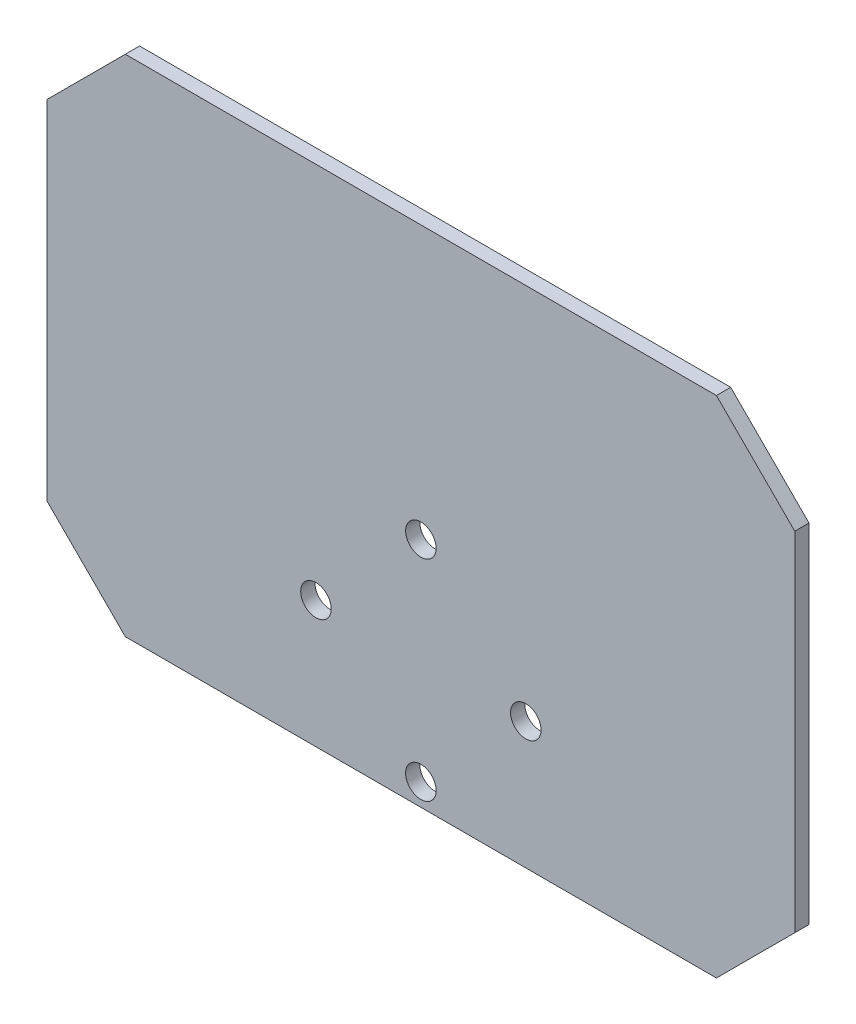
ISO-10303-21;
HEADER;
FILE_DESCRIPTION(('STEP AP214'),'2;1');
FILE_NAME('part.step','',(''),(''),'','','');
FILE_SCHEMA(('AUTOMOTIVE_DESIGN { 1 0 10303 214 1 1 1 1 }'));
ENDSEC;
DATA;
#1=APPLICATION_CONTEXT('core data for automotive mechanical design processes');
#2=APPLICATION_PROTOCOL_DEFINITION('international standard','automotive_design',2000,#1);
#3=PRODUCT_CONTEXT('',#1,'mechanical');
#4=PRODUCT('Part','Part','',(#3));
#5=PRODUCT_RELATED_PRODUCT_CATEGORY('part','',(#4));
#6=PRODUCT_DEFINITION_FORMATION('','',#4);
#7=PRODUCT_DEFINITION_CONTEXT('part definition',#1,'design');
#8=PRODUCT_DEFINITION('design','',#6,#7);
#9=PRODUCT_DEFINITION_SHAPE('','',#8);
#10=(LENGTH_UNIT() NAMED_UNIT(*) SI_UNIT(.MILLI.,.METRE.));
#11=(NAMED_UNIT(*) PLANE_ANGLE_UNIT() SI_UNIT($,.RADIAN.));
#12=(NAMED_UNIT(*) SI_UNIT($,.STERADIAN.) SOLID_ANGLE_UNIT());
#13=UNCERTAINTY_MEASURE_WITH_UNIT(LENGTH_MEASURE(1.E-05),#10,'distance_accuracy_value','');
#14=(GEOMETRIC_REPRESENTATION_CONTEXT(3) GLOBAL_UNCERTAINTY_ASSIGNED_CONTEXT((#13)) GLOBAL_UNIT_ASSIGNED_CONTEXT((#10,
#11,#12)) REPRESENTATION_CONTEXT('',''));
#15=CARTESIAN_POINT('',(0.,0.,0.));
#16=DIRECTION('',(0.,0.,1.));
#17=DIRECTION('',(1.,0.,0.));
#18=AXIS2_PLACEMENT_3D('',#15,#16,#17);
#19=CARTESIAN_POINT('',(-40.005,26.9875,1.524));
#20=DIRECTION('',(1.,0.,0.));
#21=DIRECTION('',(0.,0.,-1.));
#22=AXIS2_PLACEMENT_3D('',#19,#20,#21);
#23=PLANE('',#22);
#24=DIRECTION('',(0.,-1.,0.));
#25=VECTOR('',#24,1.);
#26=CARTESIAN_POINT('',(-40.005,26.9875,0.));
#27=LINE('',#26,#25);
#28=CARTESIAN_POINT('',(-40.005,18.6055,0.));
#29=VERTEX_POINT('',#28);
#30=CARTESIAN_POINT('',(-40.005,-18.6055,0.));
#31=VERTEX_POINT('',#30);
#32=EDGE_CURVE('E126',#29,#31,#27,.T.);
#33=ORIENTED_EDGE('',*,*,#32,.T.);
#34=DIRECTION('',(0.,0.,1.));
#35=VECTOR('',#34,1.);
#36=CARTESIAN_POINT('',(-40.005,-18.6055,1.524));
#37=LINE('',#36,#35);
#38=CARTESIAN_POINT('',(-40.005,-18.6055,1.524));
#39=VERTEX_POINT('',#38);
#40=EDGE_CURVE('E104',#31,#39,#37,.T.);
#41=ORIENTED_EDGE('',*,*,#40,.T.);
#42=DIRECTION('',(0.,-1.,0.));
#43=VECTOR('',#42,1.);
#44=CARTESIAN_POINT('',(-40.005,26.9875,1.524));
#45=LINE('',#44,#43);
#46=CARTESIAN_POINT('',(-40.005,18.6055,1.524));
#47=VERTEX_POINT('',#46);
#48=EDGE_CURVE('E136',#47,#39,#45,.T.);
#49=ORIENTED_EDGE('',*,*,#48,.F.);
#50=DIRECTION('',(0.,0.,-1.));
#51=VECTOR('',#50,1.);
#52=CARTESIAN_POINT('',(-40.005,18.6055,1.524));
#53=LINE('',#52,#51);
#54=EDGE_CURVE('E109',#47,#29,#53,.T.);
#55=ORIENTED_EDGE('',*,*,#54,.T.);
#56=EDGE_LOOP('',(#33,#41,#49,#55));
#57=FACE_BOUND('',#56,.T.);
#58=ADVANCED_FACE('F33',(#57),#23,.F.);
#59=CARTESIAN_POINT('',(-40.005,-26.9875,1.524));
#60=DIRECTION('',(0.,1.,0.));
#61=DIRECTION('',(-1.,0.,0.));
#62=AXIS2_PLACEMENT_3D('',#59,#60,#61);
#63=PLANE('',#62);
#64=DIRECTION('',(1.,0.,0.));
#65=VECTOR('',#64,1.);
#66=CARTESIAN_POINT('',(-40.005,-26.9875,1.524));
#67=LINE('',#66,#65);
#68=CARTESIAN_POINT('',(-31.623,-26.9875,1.524));
#69=VERTEX_POINT('',#68);
#70=CARTESIAN_POINT('',(31.623,-26.9875,1.524));
#71=VERTEX_POINT('',#70);
#72=EDGE_CURVE('E119',#69,#71,#67,.T.);
#73=ORIENTED_EDGE('',*,*,#72,.F.);
#74=DIRECTION('',(0.,0.,-1.));
#75=VECTOR('',#74,1.);
#76=CARTESIAN_POINT('',(-31.623,-26.9875,1.524));
#77=LINE('',#76,#75);
#78=CARTESIAN_POINT('',(-31.623,-26.9875,0.));
#79=VERTEX_POINT('',#78);
#80=EDGE_CURVE('E103',#69,#79,#77,.T.);
#81=ORIENTED_EDGE('',*,*,#80,.T.);
#82=DIRECTION('',(1.,0.,0.));
#83=VECTOR('',#82,1.);
#84=CARTESIAN_POINT('',(-40.005,-26.9875,0.));
#85=LINE('',#84,#83);
#86=CARTESIAN_POINT('',(31.623,-26.9875,0.));
#87=VERTEX_POINT('',#86);
#88=EDGE_CURVE('E116',#79,#87,#85,.T.);
#89=ORIENTED_EDGE('',*,*,#88,.T.);
#90=DIRECTION('',(0.,0.,1.));
#91=VECTOR('',#90,1.);
#92=CARTESIAN_POINT('',(31.623,-26.9875,1.524));
#93=LINE('',#92,#91);
#94=EDGE_CURVE('E121',#87,#71,#93,.T.);
#95=ORIENTED_EDGE('',*,*,#94,.T.);
#96=EDGE_LOOP('',(#73,#81,#89,#95));
#97=FACE_BOUND('',#96,.T.);
#98=ADVANCED_FACE('F115',(#97),#63,.F.);
#99=CARTESIAN_POINT('',(40.005,26.9875,1.524));
#100=DIRECTION('',(-1.,0.,0.));
#101=DIRECTION('',(0.,0.,1.));
#102=AXIS2_PLACEMENT_3D('',#99,#100,#101);
#103=PLANE('',#102);
#104=DIRECTION('',(0.,1.,0.));
#105=VECTOR('',#104,1.);
#106=CARTESIAN_POINT('',(40.005,26.9875,1.524));
#107=LINE('',#106,#105);
#108=CARTESIAN_POINT('',(40.005,-18.6055,1.524));
#109=VERTEX_POINT('',#108);
#110=CARTESIAN_POINT('',(40.005,18.6055,1.524));
#111=VERTEX_POINT('',#110);
#112=EDGE_CURVE('E162',#109,#111,#107,.T.);
#113=ORIENTED_EDGE('',*,*,#112,.F.);
#114=DIRECTION('',(0.,0.,-1.));
#115=VECTOR('',#114,1.);
#116=CARTESIAN_POINT('',(40.005,-18.6055,1.524));
#117=LINE('',#116,#115);
#118=CARTESIAN_POINT('',(40.005,-18.6055,0.));
#119=VERTEX_POINT('',#118);
#120=EDGE_CURVE('E155',#109,#119,#117,.T.);
#121=ORIENTED_EDGE('',*,*,#120,.T.);
#122=DIRECTION('',(0.,1.,0.));
#123=VECTOR('',#122,1.);
#124=CARTESIAN_POINT('',(40.005,26.9875,0.));
#125=LINE('',#124,#123);
#126=CARTESIAN_POINT('',(40.005,18.6055,0.));
#127=VERTEX_POINT('',#126);
#128=EDGE_CURVE('E125',#119,#127,#125,.T.);
#129=ORIENTED_EDGE('',*,*,#128,.T.);
#130=DIRECTION('',(0.,0.,1.));
#131=VECTOR('',#130,1.);
#132=CARTESIAN_POINT('',(40.005,18.6055,1.524));
#133=LINE('',#132,#131);
#134=EDGE_CURVE('E153',#127,#111,#133,.T.);
#135=ORIENTED_EDGE('',*,*,#134,.T.);
#136=EDGE_LOOP('',(#113,#121,#129,#135));
#137=FACE_BOUND('',#136,.T.);
#138=ADVANCED_FACE('F160',(#137),#103,.F.);
#139=CARTESIAN_POINT('',(-40.005,26.9875,1.524));
#140=DIRECTION('',(0.,-1.,0.));
#141=DIRECTION('',(1.,0.,0.));
#142=AXIS2_PLACEMENT_3D('',#139,#140,#141);
#143=PLANE('',#142);
#144=DIRECTION('',(-1.,0.,0.));
#145=VECTOR('',#144,1.);
#146=CARTESIAN_POINT('',(-40.005,26.9875,1.524));
#147=LINE('',#146,#145);
#148=CARTESIAN_POINT('',(31.623,26.9875,1.524));
#149=VERTEX_POINT('',#148);
#150=CARTESIAN_POINT('',(-31.623,26.9875,1.524));
#151=VERTEX_POINT('',#150);
#152=EDGE_CURVE('E137',#149,#151,#147,.T.);
#153=ORIENTED_EDGE('',*,*,#152,.F.);
#154=DIRECTION('',(0.,0.,-1.));
#155=VECTOR('',#154,1.);
#156=CARTESIAN_POINT('',(31.623,26.9875,1.524));
#157=LINE('',#156,#155);
#158=CARTESIAN_POINT('',(31.623,26.9875,0.));
#159=VERTEX_POINT('',#158);
#160=EDGE_CURVE('E11',#149,#159,#157,.T.);
#161=ORIENTED_EDGE('',*,*,#160,.T.);
#162=DIRECTION('',(-1.,0.,0.));
#163=VECTOR('',#162,1.);
#164=CARTESIAN_POINT('',(-40.005,26.9875,0.));
#165=LINE('',#164,#163);
#166=CARTESIAN_POINT('',(-31.623,26.9875,0.));
#167=VERTEX_POINT('',#166);
#168=EDGE_CURVE('E129',#159,#167,#165,.T.);
#169=ORIENTED_EDGE('',*,*,#168,.T.);
#170=DIRECTION('',(0.,0.,1.));
#171=VECTOR('',#170,1.);
#172=CARTESIAN_POINT('',(-31.623,26.9875,1.524));
#173=LINE('',#172,#171);
#174=EDGE_CURVE('E41',#167,#151,#173,.T.);
#175=ORIENTED_EDGE('',*,*,#174,.T.);
#176=EDGE_LOOP('',(#153,#161,#169,#175));
#177=FACE_BOUND('',#176,.T.);
#178=ADVANCED_FACE('F169',(#177),#143,.F.);
#179=CARTESIAN_POINT('',(0.,0.,1.524));
#180=DIRECTION('',(0.,0.,1.));
#181=DIRECTION('',(1.,0.,0.));
#182=AXIS2_PLACEMENT_3D('',#179,#180,#181);
#183=PLANE('',#182);
#184=CARTESIAN_POINT('',(0.,-2.17169999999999,1.524));
#185=DIRECTION('',(0.,0.,1.));
#186=DIRECTION('',(1.,0.,0.));
#187=AXIS2_PLACEMENT_3D('',#184,#185,#186);
#188=CIRCLE('',#187,1.63195);
#189=CARTESIAN_POINT('',(1.63194999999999,-2.17169999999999,1.524));
#190=VERTEX_POINT('',#189);
#191=EDGE_CURVE('E193',#190,#190,#188,.T.);
#192=ORIENTED_EDGE('',*,*,#191,.F.);
#193=EDGE_LOOP('',(#192));
#194=FACE_BOUND('',#193,.T.);
#195=CARTESIAN_POINT('',(0.,-24.6253,1.524));
#196=DIRECTION('',(0.,0.,1.));
#197=DIRECTION('',(1.,0.,0.));
#198=AXIS2_PLACEMENT_3D('',#195,#196,#197);
#199=CIRCLE('',#198,1.63195);
#200=CARTESIAN_POINT('',(1.63194999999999,-24.6253,1.524));
#201=VERTEX_POINT('',#200);
#202=EDGE_CURVE('E187',#201,#201,#199,.T.);
#203=ORIENTED_EDGE('',*,*,#202,.F.);
#204=EDGE_LOOP('',(#203));
#205=FACE_BOUND('',#204,.T.);
#206=CARTESIAN_POINT('',(11.2268,-13.3985,1.524));
#207=DIRECTION('',(0.,0.,1.));
#208=DIRECTION('',(1.,0.,0.));
#209=AXIS2_PLACEMENT_3D('',#206,#207,#208);
#210=CIRCLE('',#209,1.63194999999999);
#211=CARTESIAN_POINT('',(12.85875,-13.3985,1.524));
#212=VERTEX_POINT('',#211);
#213=EDGE_CURVE('E181',#212,#212,#210,.T.);
#214=ORIENTED_EDGE('',*,*,#213,.F.);
#215=EDGE_LOOP('',(#214));
#216=FACE_BOUND('',#215,.T.);
#217=CARTESIAN_POINT('',(-11.2268,-13.3985,1.524));
#218=DIRECTION('',(0.,0.,1.));
#219=DIRECTION('',(1.,0.,0.));
#220=AXIS2_PLACEMENT_3D('',#217,#218,#219);
#221=CIRCLE('',#220,1.63194999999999);
#222=CARTESIAN_POINT('',(-9.59485000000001,-13.3985,1.524));
#223=VERTEX_POINT('',#222);
#224=EDGE_CURVE('E131',#223,#223,#221,.T.);
#225=ORIENTED_EDGE('',*,*,#224,.F.);
#226=EDGE_LOOP('',(#225));
#227=FACE_BOUND('',#226,.T.);
#228=ORIENTED_EDGE('',*,*,#48,.T.);
#229=DIRECTION('',(-0.707106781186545,0.70710678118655,0.));
#230=VECTOR('',#229,1.);
#231=CARTESIAN_POINT('',(-29.3052500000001,-29.3052499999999,1.524));
#232=LINE('',#231,#230);
#233=EDGE_CURVE('E151',#39,#69,#232,.F.);
#234=ORIENTED_EDGE('',*,*,#233,.T.);
#235=ORIENTED_EDGE('',*,*,#72,.T.);
#236=DIRECTION('',(-0.707106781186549,-0.707106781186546,0.));
#237=VECTOR('',#236,1.);
#238=CARTESIAN_POINT('',(29.3052499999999,-29.30525,1.524));
#239=LINE('',#238,#237);
#240=EDGE_CURVE('E149',#71,#109,#239,.F.);
#241=ORIENTED_EDGE('',*,*,#240,.T.);
#242=ORIENTED_EDGE('',*,*,#112,.T.);
#243=DIRECTION('',(0.707106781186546,-0.707106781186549,0.));
#244=VECTOR('',#243,1.);
#245=CARTESIAN_POINT('',(29.3052500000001,29.3052499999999,1.524));
#246=LINE('',#245,#244);
#247=EDGE_CURVE('E54',#111,#149,#246,.F.);
#248=ORIENTED_EDGE('',*,*,#247,.T.);
#249=ORIENTED_EDGE('',*,*,#152,.T.);
#250=DIRECTION('',(0.70710678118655,0.707106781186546,0.));
#251=VECTOR('',#250,1.);
#252=CARTESIAN_POINT('',(-29.3052499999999,29.3052500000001,1.524));
#253=LINE('',#252,#251);
#254=EDGE_CURVE('E146',#151,#47,#253,.F.);
#255=ORIENTED_EDGE('',*,*,#254,.T.);
#256=EDGE_LOOP('',(#228,#234,#235,#241,#242,#248,#249,#255));
#257=FACE_BOUND('',#256,.T.);
#258=ADVANCED_FACE('F204',(#194,#205,#216,#227,#257),#183,.T.);
#259=CARTESIAN_POINT('',(0.,0.,0.));
#260=DIRECTION('',(0.,0.,1.));
#261=DIRECTION('',(1.,0.,0.));
#262=AXIS2_PLACEMENT_3D('',#259,#260,#261);
#263=PLANE('',#262);
#264=CARTESIAN_POINT('',(0.,-2.17169999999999,0.));
#265=DIRECTION('',(0.,0.,-1.));
#266=DIRECTION('',(-1.,0.,0.));
#267=AXIS2_PLACEMENT_3D('',#264,#265,#266);
#268=CIRCLE('',#267,1.63195);
#269=CARTESIAN_POINT('',(-1.63195,-2.17169999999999,0.));
#270=VERTEX_POINT('',#269);
#271=EDGE_CURVE('E196',#270,#270,#268,.T.);
#272=ORIENTED_EDGE('',*,*,#271,.F.);
#273=EDGE_LOOP('',(#272));
#274=FACE_BOUND('',#273,.T.);
#275=CARTESIAN_POINT('',(0.,-24.6253,0.));
#276=DIRECTION('',(0.,0.,-1.));
#277=DIRECTION('',(-1.,0.,0.));
#278=AXIS2_PLACEMENT_3D('',#275,#276,#277);
#279=CIRCLE('',#278,1.63195);
#280=CARTESIAN_POINT('',(-1.63195,-24.6253,0.));
#281=VERTEX_POINT('',#280);
#282=EDGE_CURVE('E190',#281,#281,#279,.T.);
#283=ORIENTED_EDGE('',*,*,#282,.F.);
#284=EDGE_LOOP('',(#283));
#285=FACE_BOUND('',#284,.T.);
#286=CARTESIAN_POINT('',(11.2268,-13.3985,0.));
#287=DIRECTION('',(0.,0.,-1.));
#288=DIRECTION('',(-1.,0.,0.));
#289=AXIS2_PLACEMENT_3D('',#286,#287,#288);
#290=CIRCLE('',#289,1.63195);
#291=CARTESIAN_POINT('',(9.59485,-13.3985,0.));
#292=VERTEX_POINT('',#291);
#293=EDGE_CURVE('E184',#292,#292,#290,.T.);
#294=ORIENTED_EDGE('',*,*,#293,.F.);
#295=EDGE_LOOP('',(#294));
#296=FACE_BOUND('',#295,.T.);
#297=CARTESIAN_POINT('',(-11.2268,-13.3985,0.));
#298=DIRECTION('',(0.,0.,-1.));
#299=DIRECTION('',(-1.,0.,0.));
#300=AXIS2_PLACEMENT_3D('',#297,#298,#299);
#301=CIRCLE('',#300,1.63195);
#302=CARTESIAN_POINT('',(-12.85875,-13.3985,0.));
#303=VERTEX_POINT('',#302);
#304=EDGE_CURVE('E178',#303,#303,#301,.T.);
#305=ORIENTED_EDGE('',*,*,#304,.F.);
#306=EDGE_LOOP('',(#305));
#307=FACE_BOUND('',#306,.T.);
#308=ORIENTED_EDGE('',*,*,#88,.F.);
#309=DIRECTION('',(0.707106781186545,-0.70710678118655,0.));
#310=VECTOR('',#309,1.);
#311=CARTESIAN_POINT('',(-31.623,-26.9875,0.));
#312=LINE('',#311,#310);
#313=EDGE_CURVE('E99',#79,#31,#312,.F.);
#314=ORIENTED_EDGE('',*,*,#313,.T.);
#315=ORIENTED_EDGE('',*,*,#32,.F.);
#316=DIRECTION('',(-0.70710678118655,-0.707106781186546,0.));
#317=VECTOR('',#316,1.);
#318=CARTESIAN_POINT('',(-40.005,18.6055,0.));
#319=LINE('',#318,#317);
#320=EDGE_CURVE('E120',#29,#167,#319,.F.);
#321=ORIENTED_EDGE('',*,*,#320,.T.);
#322=ORIENTED_EDGE('',*,*,#168,.F.);
#323=DIRECTION('',(-0.707106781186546,0.707106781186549,0.));
#324=VECTOR('',#323,1.);
#325=CARTESIAN_POINT('',(31.623,26.9875,0.));
#326=LINE('',#325,#324);
#327=EDGE_CURVE('E140',#159,#127,#326,.F.);
#328=ORIENTED_EDGE('',*,*,#327,.T.);
#329=ORIENTED_EDGE('',*,*,#128,.F.);
#330=DIRECTION('',(0.707106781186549,0.707106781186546,0.));
#331=VECTOR('',#330,1.);
#332=CARTESIAN_POINT('',(40.005,-18.6055,0.));
#333=LINE('',#332,#331);
#334=EDGE_CURVE('E110',#119,#87,#333,.F.);
#335=ORIENTED_EDGE('',*,*,#334,.T.);
#336=EDGE_LOOP('',(#308,#314,#315,#321,#322,#328,#329,#335));
#337=FACE_BOUND('',#336,.T.);
#338=ADVANCED_FACE('F123',(#274,#285,#296,#307,#337),#263,.F.);
#339=CARTESIAN_POINT('',(-31.623,-26.9875,1.524));
#340=DIRECTION('',(0.70710678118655,0.707106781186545,0.));
#341=DIRECTION('',(0.,0.,-1.));
#342=AXIS2_PLACEMENT_3D('',#339,#340,#341);
#343=PLANE('',#342);
#344=ORIENTED_EDGE('',*,*,#233,.F.);
#345=ORIENTED_EDGE('',*,*,#40,.F.);
#346=ORIENTED_EDGE('',*,*,#313,.F.);
#347=ORIENTED_EDGE('',*,*,#80,.F.);
#348=EDGE_LOOP('',(#344,#345,#346,#347));
#349=FACE_BOUND('',#348,.T.);
#350=ADVANCED_FACE('F102',(#349),#343,.F.);
#351=CARTESIAN_POINT('',(40.005,-18.6055,1.524));
#352=DIRECTION('',(-0.707106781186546,0.707106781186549,0.));
#353=DIRECTION('',(0.,0.,-1.));
#354=AXIS2_PLACEMENT_3D('',#351,#352,#353);
#355=PLANE('',#354);
#356=ORIENTED_EDGE('',*,*,#240,.F.);
#357=ORIENTED_EDGE('',*,*,#94,.F.);
#358=ORIENTED_EDGE('',*,*,#334,.F.);
#359=ORIENTED_EDGE('',*,*,#120,.F.);
#360=EDGE_LOOP('',(#356,#357,#358,#359));
#361=FACE_BOUND('',#360,.T.);
#362=ADVANCED_FACE('F237',(#361),#355,.F.);
#363=CARTESIAN_POINT('',(31.623,26.9875,1.524));
#364=DIRECTION('',(-0.707106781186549,-0.707106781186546,0.));
#365=DIRECTION('',(0.,0.,-1.));
#366=AXIS2_PLACEMENT_3D('',#363,#364,#365);
#367=PLANE('',#366);
#368=ORIENTED_EDGE('',*,*,#247,.F.);
#369=ORIENTED_EDGE('',*,*,#134,.F.);
#370=ORIENTED_EDGE('',*,*,#327,.F.);
#371=ORIENTED_EDGE('',*,*,#160,.F.);
#372=EDGE_LOOP('',(#368,#369,#370,#371));
#373=FACE_BOUND('',#372,.T.);
#374=ADVANCED_FACE('F168',(#373),#367,.F.);
#375=CARTESIAN_POINT('',(-40.005,18.6055,1.524));
#376=DIRECTION('',(0.707106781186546,-0.70710678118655,0.));
#377=DIRECTION('',(0.,0.,-1.));
#378=AXIS2_PLACEMENT_3D('',#375,#376,#377);
#379=PLANE('',#378);
#380=ORIENTED_EDGE('',*,*,#254,.F.);
#381=ORIENTED_EDGE('',*,*,#174,.F.);
#382=ORIENTED_EDGE('',*,*,#320,.F.);
#383=ORIENTED_EDGE('',*,*,#54,.F.);
#384=EDGE_LOOP('',(#380,#381,#382,#383));
#385=FACE_BOUND('',#384,.T.);
#386=ADVANCED_FACE('F35',(#385),#379,.F.);
#387=CARTESIAN_POINT('',(-11.2268,-13.3985,0.));
#388=DIRECTION('',(0.,0.,-1.));
#389=DIRECTION('',(-1.,0.,0.));
#390=AXIS2_PLACEMENT_3D('',#387,#388,#389);
#391=CYLINDRICAL_SURFACE('',#390,1.63194999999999);
#392=ORIENTED_EDGE('',*,*,#224,.T.);
#393=EDGE_LOOP('',(#392));
#394=FACE_BOUND('',#393,.T.);
#395=ORIENTED_EDGE('',*,*,#304,.T.);
#396=EDGE_LOOP('',(#395));
#397=FACE_BOUND('',#396,.T.);
#398=ADVANCED_FACE('F212',(#394,#397),#391,.F.);
#399=CARTESIAN_POINT('',(11.2268,-13.3985,0.));
#400=DIRECTION('',(0.,0.,-1.));
#401=DIRECTION('',(-1.,0.,0.));
#402=AXIS2_PLACEMENT_3D('',#399,#400,#401);
#403=CYLINDRICAL_SURFACE('',#402,1.63194999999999);
#404=ORIENTED_EDGE('',*,*,#213,.T.);
#405=EDGE_LOOP('',(#404));
#406=FACE_BOUND('',#405,.T.);
#407=ORIENTED_EDGE('',*,*,#293,.T.);
#408=EDGE_LOOP('',(#407));
#409=FACE_BOUND('',#408,.T.);
#410=ADVANCED_FACE('F214',(#406,#409),#403,.F.);
#411=CARTESIAN_POINT('',(0.,-24.6253,0.));
#412=DIRECTION('',(0.,0.,-1.));
#413=DIRECTION('',(-1.,0.,0.));
#414=AXIS2_PLACEMENT_3D('',#411,#412,#413);
#415=CYLINDRICAL_SURFACE('',#414,1.63195);
#416=ORIENTED_EDGE('',*,*,#202,.T.);
#417=EDGE_LOOP('',(#416));
#418=FACE_BOUND('',#417,.T.);
#419=ORIENTED_EDGE('',*,*,#282,.T.);
#420=EDGE_LOOP('',(#419));
#421=FACE_BOUND('',#420,.T.);
#422=ADVANCED_FACE('F221',(#418,#421),#415,.F.);
#423=CARTESIAN_POINT('',(0.,-2.17169999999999,0.));
#424=DIRECTION('',(0.,0.,-1.));
#425=DIRECTION('',(-1.,0.,0.));
#426=AXIS2_PLACEMENT_3D('',#423,#424,#425);
#427=CYLINDRICAL_SURFACE('',#426,1.63195);
#428=ORIENTED_EDGE('',*,*,#191,.T.);
#429=EDGE_LOOP('',(#428));
#430=FACE_BOUND('',#429,.T.);
#431=ORIENTED_EDGE('',*,*,#271,.T.);
#432=EDGE_LOOP('',(#431));
#433=FACE_BOUND('',#432,.T.);
#434=ADVANCED_FACE('F200',(#430,#433),#427,.F.);
#435=CLOSED_SHELL('',(#58,#98,#138,#178,#258,#338,#350,#362,#374,#386,#398,#410,#422,#434));
#436=MANIFOLD_SOLID_BREP('B2',#435);
#437=ADVANCED_BREP_SHAPE_REPRESENTATION('',(#18,#436),#14);
#438=SHAPE_DEFINITION_REPRESENTATION(#9,#437);
ENDSEC;
END-ISO-10303-21;
